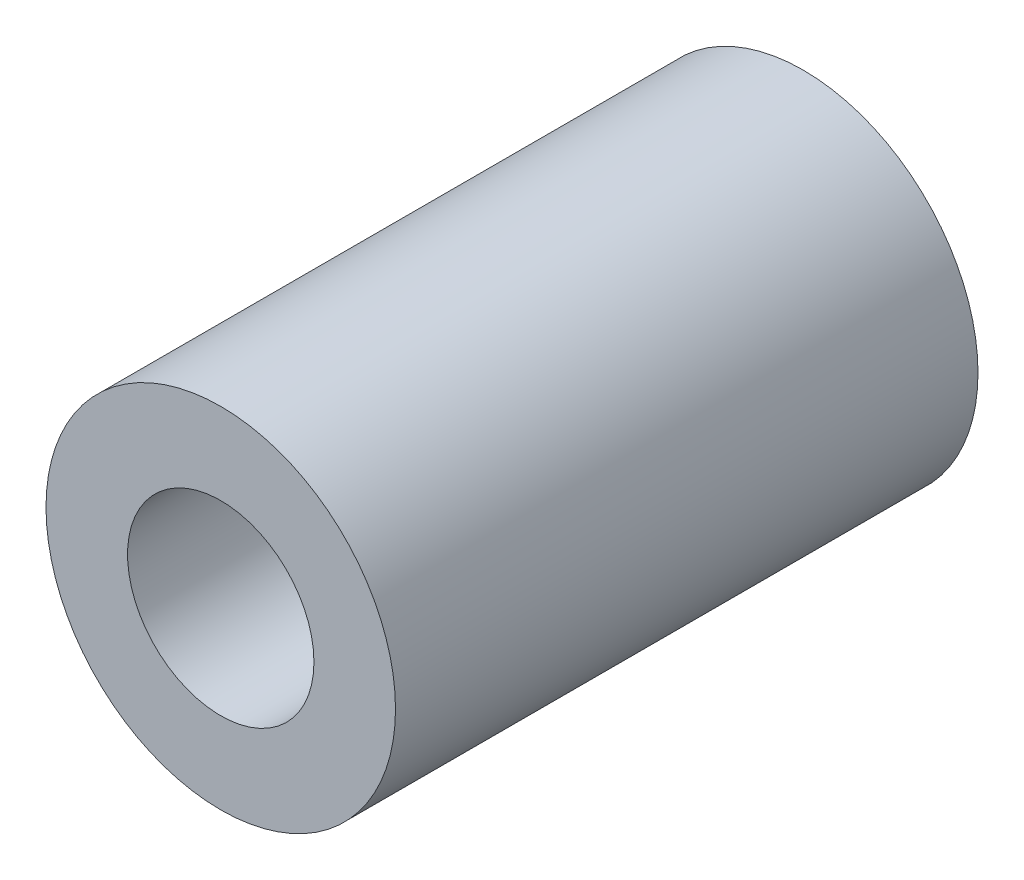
from build123d import *

# Parameters (mm, degrees)
CROQUIS1_R     = 7.5
CROQUIS1_R_2   = 4
EXTRUIR1_DEPTH = 25


with BuildPart() as part:
    # Croquis1 → Extruir1 (new body)
    with BuildSketch(Plane.XY):
        Circle(CROQUIS1_R)
        Circle(CROQUIS1_R_2, mode=Mode.SUBTRACT)
    extrude(amount=EXTRUIR1_DEPTH)


solid = part.part
